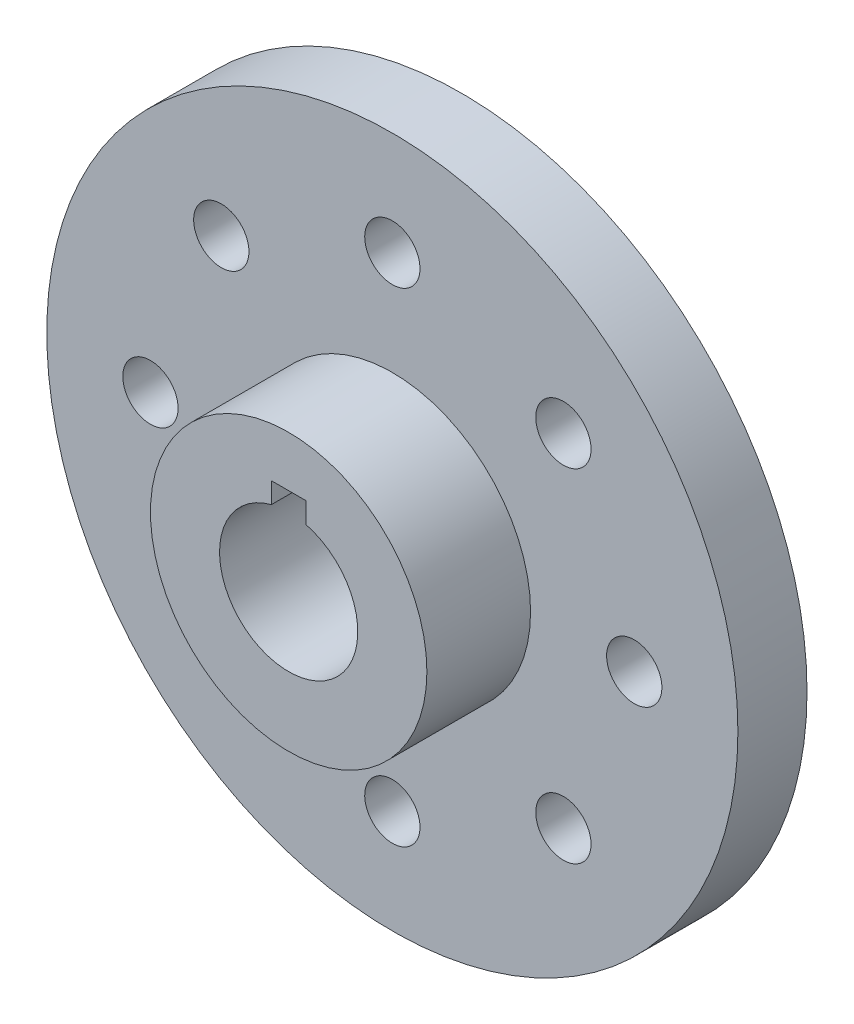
from build123d import *

# Parameters (mm, degrees)
SKETCH2_R          = 10
CUT_EXTRUDE1_DEPTH = 76
SKETCH3_R          = 4
CUT_EXTRUDE2_DEPTH = 73.284161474
CIRPATTERN1_COUNT  = 8
CUT_EXTRUDE3_DEPTH = 76


with BuildPart() as part:
    # Sketch1 → Revolve1 (revolve)
    with BuildSketch(Plane(origin=(0, 0, 0), x_dir=(0, 0, -1), z_dir=(1, 0, 0)), mode=Mode.PRIVATE) as revolve1_sk:
        Polygon((0, 0), (0, 20), (15, 20), (15, 50), (25, 50), (25, 0), align=None)
    revolve(revolve1_sk.sketch.rotate(Axis((0, 0, 0), (0, 0, -1)), 90), axis=Axis((0, 0, 0), (0, 0, -1)))

    # Sketch2 → Cut-Extrude1 (cut, through all)
    with BuildSketch(Plane.XY):
        Circle(SKETCH2_R)
    extrude(amount=-CUT_EXTRUDE1_DEPTH, mode=Mode.SUBTRACT)

    # Sketch3 → Cut-Extrude2 (cut, through all)
    with BuildSketch(Plane.XY.offset(-15)):
        with Locations((24.748737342, 24.748737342)):
            Circle(SKETCH3_R)
    cut_extrude2 = extrude(amount=-CUT_EXTRUDE2_DEPTH, mode=Mode.SUBTRACT)

    # CirPattern1: Cut-Extrude2 ×8 about axis
    cirpattern1_axis = Axis((0, 0, 0), (0, 0, -1))
    for i in range(1, CIRPATTERN1_COUNT):
        add(cut_extrude2.rotate(cirpattern1_axis, i * 360 / CIRPATTERN1_COUNT), mode=Mode.SUBTRACT)

    # Sketch4 → Cut-Extrude3 (cut, through all)
    with BuildSketch(Plane.XY):
        with BuildLine():
            Line((2.5, 9.682458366), (2.5, 12.682458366))
            Line((2.5, 12.682458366), (-2.5, 12.682458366))
            Line((-2.5, 12.682458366), (-2.5, 9.682458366))
            ThreePointArc((-2.5, 9.682458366), (0, 10), (2.5, 9.682458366))
        make_face()
    extrude(amount=-CUT_EXTRUDE3_DEPTH, mode=Mode.SUBTRACT)


solid = part.part
